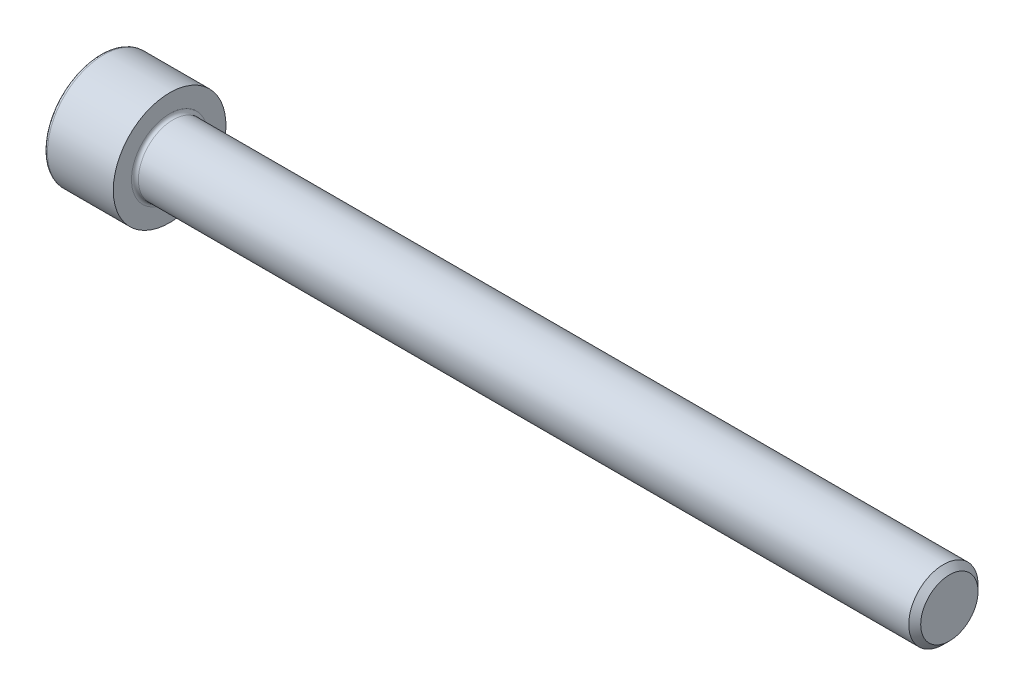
ISO-10303-21;
HEADER;
FILE_DESCRIPTION(('STEP AP214'),'2;1');
FILE_NAME('part.step','',(''),(''),'','','');
FILE_SCHEMA(('AUTOMOTIVE_DESIGN { 1 0 10303 214 1 1 1 1 }'));
ENDSEC;
DATA;
#1=APPLICATION_CONTEXT('core data for automotive mechanical design processes');
#2=APPLICATION_PROTOCOL_DEFINITION('international standard','automotive_design',2000,#1);
#3=PRODUCT_CONTEXT('',#1,'mechanical');
#4=PRODUCT('Part','Part','',(#3));
#5=PRODUCT_RELATED_PRODUCT_CATEGORY('part','',(#4));
#6=PRODUCT_DEFINITION_FORMATION('','',#4);
#7=PRODUCT_DEFINITION_CONTEXT('part definition',#1,'design');
#8=PRODUCT_DEFINITION('design','',#6,#7);
#9=PRODUCT_DEFINITION_SHAPE('','',#8);
#10=(LENGTH_UNIT() NAMED_UNIT(*) SI_UNIT(.MILLI.,.METRE.));
#11=(NAMED_UNIT(*) PLANE_ANGLE_UNIT() SI_UNIT($,.RADIAN.));
#12=(NAMED_UNIT(*) SI_UNIT($,.STERADIAN.) SOLID_ANGLE_UNIT());
#13=UNCERTAINTY_MEASURE_WITH_UNIT(LENGTH_MEASURE(1.E-05),#10,'distance_accuracy_value','');
#14=(GEOMETRIC_REPRESENTATION_CONTEXT(3) GLOBAL_UNCERTAINTY_ASSIGNED_CONTEXT((#13)) GLOBAL_UNIT_ASSIGNED_CONTEXT((#10,
#11,#12)) REPRESENTATION_CONTEXT('',''));
#15=CARTESIAN_POINT('',(0.,0.,0.));
#16=DIRECTION('',(0.,0.,1.));
#17=DIRECTION('',(1.,0.,0.));
#18=AXIS2_PLACEMENT_3D('',#15,#16,#17);
#19=CARTESIAN_POINT('',(0.,0.,0.));
#20=DIRECTION('',(-1.,0.,0.));
#21=DIRECTION('',(0.,0.,1.));
#22=AXIS2_PLACEMENT_3D('',#19,#20,#21);
#23=PLANE('',#22);
#24=DIRECTION('',(0.,-0.499999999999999,0.866025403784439));
#25=VECTOR('',#24,1.);
#26=CARTESIAN_POINT('',(0.,3.51894989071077,0.));
#27=LINE('',#26,#25);
#28=CARTESIAN_POINT('',(0.,3.51894989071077,0.));
#29=VERTEX_POINT('',#28);
#30=CARTESIAN_POINT('',(0.,1.75947494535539,3.0475));
#31=VERTEX_POINT('',#30);
#32=EDGE_CURVE('E263',#29,#31,#27,.T.);
#33=ORIENTED_EDGE('',*,*,#32,.T.);
#34=DIRECTION('',(0.,1.,0.));
#35=VECTOR('',#34,1.);
#36=CARTESIAN_POINT('',(0.,-1.75947494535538,3.04750000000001));
#37=LINE('',#36,#35);
#38=CARTESIAN_POINT('',(0.,-1.75947494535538,3.04750000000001));
#39=VERTEX_POINT('',#38);
#40=EDGE_CURVE('E137',#39,#31,#37,.T.);
#41=ORIENTED_EDGE('',*,*,#40,.F.);
#42=DIRECTION('',(0.,-0.500000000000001,-0.866025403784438));
#43=VECTOR('',#42,1.);
#44=CARTESIAN_POINT('',(0.,-1.75947494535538,3.04750000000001));
#45=LINE('',#44,#43);
#46=CARTESIAN_POINT('',(0.,-3.51894989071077,0.));
#47=VERTEX_POINT('',#46);
#48=EDGE_CURVE('E270',#39,#47,#45,.T.);
#49=ORIENTED_EDGE('',*,*,#48,.T.);
#50=DIRECTION('',(0.,0.499999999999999,-0.866025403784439));
#51=VECTOR('',#50,1.);
#52=CARTESIAN_POINT('',(0.,-3.51894989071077,0.));
#53=LINE('',#52,#51);
#54=CARTESIAN_POINT('',(0.,-1.75947494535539,-3.0475));
#55=VERTEX_POINT('',#54);
#56=EDGE_CURVE('E268',#47,#55,#53,.T.);
#57=ORIENTED_EDGE('',*,*,#56,.T.);
#58=DIRECTION('',(0.,-1.,0.));
#59=VECTOR('',#58,1.);
#60=CARTESIAN_POINT('',(0.,1.75947494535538,-3.0475));
#61=LINE('',#60,#59);
#62=CARTESIAN_POINT('',(0.,1.75947494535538,-3.0475));
#63=VERTEX_POINT('',#62);
#64=EDGE_CURVE('E271',#63,#55,#61,.T.);
#65=ORIENTED_EDGE('',*,*,#64,.F.);
#66=DIRECTION('',(0.,-0.500000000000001,-0.866025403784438));
#67=VECTOR('',#66,1.);
#68=CARTESIAN_POINT('',(0.,3.51894989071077,0.));
#69=LINE('',#68,#67);
#70=EDGE_CURVE('E131',#29,#63,#69,.T.);
#71=ORIENTED_EDGE('',*,*,#70,.F.);
#72=EDGE_LOOP('',(#33,#41,#49,#57,#65,#71));
#73=FACE_BOUND('',#72,.T.);
#74=CARTESIAN_POINT('',(0.,0.,0.));
#75=DIRECTION('',(-1.,0.,0.));
#76=DIRECTION('',(0.,0.,1.));
#77=AXIS2_PLACEMENT_3D('',#74,#75,#76);
#78=CIRCLE('',#77,6.1);
#79=CARTESIAN_POINT('',(0.,0.,6.1));
#80=VERTEX_POINT('',#79);
#81=EDGE_CURVE('E48',#80,#80,#78,.T.);
#82=ORIENTED_EDGE('',*,*,#81,.T.);
#83=EDGE_LOOP('',(#82));
#84=FACE_BOUND('',#83,.T.);
#85=ADVANCED_FACE('F37',(#73,#84),#23,.T.);
#86=CARTESIAN_POINT('',(-31.75,0.,0.));
#87=DIRECTION('',(-1.,0.,0.));
#88=DIRECTION('',(0.,0.,1.));
#89=AXIS2_PLACEMENT_3D('',#86,#87,#88);
#90=CYLINDRICAL_SURFACE('',#89,6.5);
#91=CARTESIAN_POINT('',(0.399999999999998,0.,0.));
#92=DIRECTION('',(-1.,0.,0.));
#93=DIRECTION('',(0.,0.,1.));
#94=AXIS2_PLACEMENT_3D('',#91,#92,#93);
#95=CIRCLE('',#94,6.5);
#96=CARTESIAN_POINT('',(0.399999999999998,0.,6.5));
#97=VERTEX_POINT('',#96);
#98=EDGE_CURVE('E11',#97,#97,#95,.F.);
#99=ORIENTED_EDGE('',*,*,#98,.T.);
#100=EDGE_LOOP('',(#99));
#101=FACE_BOUND('',#100,.T.);
#102=CARTESIAN_POINT('',(8.,0.,0.));
#103=DIRECTION('',(-1.,0.,0.));
#104=DIRECTION('',(0.,0.,1.));
#105=AXIS2_PLACEMENT_3D('',#102,#103,#104);
#106=CIRCLE('',#105,6.5);
#107=CARTESIAN_POINT('',(8.,0.,6.5));
#108=VERTEX_POINT('',#107);
#109=EDGE_CURVE('E153',#108,#108,#106,.T.);
#110=ORIENTED_EDGE('',*,*,#109,.T.);
#111=EDGE_LOOP('',(#110));
#112=FACE_BOUND('',#111,.T.);
#113=ADVANCED_FACE('F177',(#101,#112),#90,.T.);
#114=CARTESIAN_POINT('',(8.,6.5,0.));
#115=DIRECTION('',(1.,0.,0.));
#116=DIRECTION('',(0.,0.,-1.));
#117=AXIS2_PLACEMENT_3D('',#114,#115,#116);
#118=PLANE('',#117);
#119=CARTESIAN_POINT('',(8.,0.,0.));
#120=DIRECTION('',(1.,0.,0.));
#121=DIRECTION('',(0.,0.,-1.));
#122=AXIS2_PLACEMENT_3D('',#119,#120,#121);
#123=CIRCLE('',#122,4.4);
#124=CARTESIAN_POINT('',(8.,0.,-4.4));
#125=VERTEX_POINT('',#124);
#126=EDGE_CURVE('E160',#125,#125,#123,.F.);
#127=ORIENTED_EDGE('',*,*,#126,.T.);
#128=EDGE_LOOP('',(#127));
#129=FACE_BOUND('',#128,.T.);
#130=ORIENTED_EDGE('',*,*,#109,.F.);
#131=EDGE_LOOP('',(#130));
#132=FACE_BOUND('',#131,.T.);
#133=ADVANCED_FACE('F183',(#129,#132),#118,.T.);
#134=CARTESIAN_POINT('',(-31.75,0.,0.));
#135=DIRECTION('',(-1.,0.,0.));
#136=DIRECTION('',(0.,0.,1.));
#137=AXIS2_PLACEMENT_3D('',#134,#135,#136);
#138=CYLINDRICAL_SURFACE('',#137,4.);
#139=CARTESIAN_POINT('',(8.4,0.,0.));
#140=DIRECTION('',(1.,0.,0.));
#141=DIRECTION('',(0.,0.,-1.));
#142=AXIS2_PLACEMENT_3D('',#139,#140,#141);
#143=CIRCLE('',#142,4.);
#144=CARTESIAN_POINT('',(8.4,0.,-4.));
#145=VERTEX_POINT('',#144);
#146=EDGE_CURVE('E158',#145,#145,#143,.T.);
#147=ORIENTED_EDGE('',*,*,#146,.T.);
#148=EDGE_LOOP('',(#147));
#149=FACE_BOUND('',#148,.T.);
#150=CARTESIAN_POINT('',(97.3095,0.,0.));
#151=DIRECTION('',(-1.,0.,0.));
#152=DIRECTION('',(0.,0.,1.));
#153=AXIS2_PLACEMENT_3D('',#150,#151,#152);
#154=CIRCLE('',#153,4.);
#155=CARTESIAN_POINT('',(97.3095,0.,4.));
#156=VERTEX_POINT('',#155);
#157=EDGE_CURVE('E151',#156,#156,#154,.T.);
#158=ORIENTED_EDGE('',*,*,#157,.T.);
#159=EDGE_LOOP('',(#158));
#160=FACE_BOUND('',#159,.T.);
#161=ADVANCED_FACE('F188',(#149,#160),#138,.T.);
#162=CARTESIAN_POINT('',(98.,0.,0.));
#163=DIRECTION('',(-1.,0.,0.));
#164=DIRECTION('',(0.,0.,1.));
#165=AXIS2_PLACEMENT_3D('',#162,#163,#164);
#166=CONICAL_SURFACE('',#165,3.3095,0.785398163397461);
#167=ORIENTED_EDGE('',*,*,#157,.F.);
#168=EDGE_LOOP('',(#167));
#169=FACE_BOUND('',#168,.T.);
#170=CARTESIAN_POINT('',(98.,0.,0.));
#171=DIRECTION('',(-1.,0.,0.));
#172=DIRECTION('',(0.,0.,1.));
#173=AXIS2_PLACEMENT_3D('',#170,#171,#172);
#174=CIRCLE('',#173,3.3095);
#175=CARTESIAN_POINT('',(98.,0.,3.3095));
#176=VERTEX_POINT('',#175);
#177=EDGE_CURVE('E150',#176,#176,#174,.T.);
#178=ORIENTED_EDGE('',*,*,#177,.T.);
#179=EDGE_LOOP('',(#178));
#180=FACE_BOUND('',#179,.T.);
#181=ADVANCED_FACE('F194',(#169,#180),#166,.T.);
#182=CARTESIAN_POINT('',(98.,3.3095,0.));
#183=DIRECTION('',(1.,0.,0.));
#184=DIRECTION('',(0.,0.,-1.));
#185=AXIS2_PLACEMENT_3D('',#182,#183,#184);
#186=PLANE('',#185);
#187=ORIENTED_EDGE('',*,*,#177,.F.);
#188=EDGE_LOOP('',(#187));
#189=FACE_BOUND('',#188,.T.);
#190=ADVANCED_FACE('F176',(#189),#186,.T.);
#191=CARTESIAN_POINT('',(8.4,0.,0.));
#192=DIRECTION('',(1.,0.,0.));
#193=DIRECTION('',(0.,0.,-1.));
#194=AXIS2_PLACEMENT_3D('',#191,#192,#193);
#195=TOROIDAL_SURFACE('',#194,4.4,0.4);
#196=ORIENTED_EDGE('',*,*,#146,.F.);
#197=EDGE_LOOP('',(#196));
#198=FACE_BOUND('',#197,.T.);
#199=ORIENTED_EDGE('',*,*,#126,.F.);
#200=EDGE_LOOP('',(#199));
#201=FACE_BOUND('',#200,.T.);
#202=ADVANCED_FACE('F170',(#198,#201),#195,.F.);
#203=CARTESIAN_POINT('',(0.399999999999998,0.,0.));
#204=DIRECTION('',(-1.,0.,0.));
#205=DIRECTION('',(0.,0.,1.));
#206=AXIS2_PLACEMENT_3D('',#203,#204,#205);
#207=TOROIDAL_SURFACE('',#206,6.1,0.4);
#208=ORIENTED_EDGE('',*,*,#98,.F.);
#209=EDGE_LOOP('',(#208));
#210=FACE_BOUND('',#209,.T.);
#211=ORIENTED_EDGE('',*,*,#81,.F.);
#212=EDGE_LOOP('',(#211));
#213=FACE_BOUND('',#212,.T.);
#214=ADVANCED_FACE('F45',(#210,#213),#207,.T.);
#215=CARTESIAN_POINT('',(4.,3.51894989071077,0.));
#216=DIRECTION('',(0.,-0.866025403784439,-0.499999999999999));
#217=DIRECTION('',(0.,0.499999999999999,-0.866025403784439));
#218=AXIS2_PLACEMENT_3D('',#215,#216,#217);
#219=PLANE('',#218);
#220=ORIENTED_EDGE('',*,*,#32,.F.);
#221=DIRECTION('',(-1.,0.,0.));
#222=VECTOR('',#221,1.);
#223=CARTESIAN_POINT('',(4.,3.51894989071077,0.));
#224=LINE('',#223,#222);
#225=CARTESIAN_POINT('',(4.,3.51894989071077,0.));
#226=VERTEX_POINT('',#225);
#227=EDGE_CURVE('E251',#226,#29,#224,.T.);
#228=ORIENTED_EDGE('',*,*,#227,.F.);
#229=DIRECTION('',(0.,-0.499999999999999,0.866025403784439));
#230=VECTOR('',#229,1.);
#231=CARTESIAN_POINT('',(4.,3.51894989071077,0.));
#232=LINE('',#231,#230);
#233=CARTESIAN_POINT('',(4.,2.63921241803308,1.52375));
#234=VERTEX_POINT('',#233);
#235=EDGE_CURVE('E124',#226,#234,#232,.T.);
#236=ORIENTED_EDGE('',*,*,#235,.T.);
#237=CARTESIAN_POINT('',(4.,1.75947494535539,3.0475));
#238=VERTEX_POINT('',#237);
#239=EDGE_CURVE('E112',#234,#238,#232,.T.);
#240=ORIENTED_EDGE('',*,*,#239,.T.);
#241=DIRECTION('',(-1.,0.,0.));
#242=VECTOR('',#241,1.);
#243=CARTESIAN_POINT('',(4.,1.75947494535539,3.0475));
#244=LINE('',#243,#242);
#245=EDGE_CURVE('E128',#238,#31,#244,.T.);
#246=ORIENTED_EDGE('',*,*,#245,.T.);
#247=EDGE_LOOP('',(#220,#228,#236,#240,#246));
#248=FACE_BOUND('',#247,.T.);
#249=ADVANCED_FACE('F130',(#248),#219,.T.);
#250=CARTESIAN_POINT('',(4.,-1.75947494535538,3.04750000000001));
#251=DIRECTION('',(0.,0.,1.));
#252=DIRECTION('',(0.,-1.,0.));
#253=AXIS2_PLACEMENT_3D('',#250,#251,#252);
#254=PLANE('',#253);
#255=ORIENTED_EDGE('',*,*,#40,.T.);
#256=ORIENTED_EDGE('',*,*,#245,.F.);
#257=DIRECTION('',(0.,1.,0.));
#258=VECTOR('',#257,1.);
#259=CARTESIAN_POINT('',(4.,-1.75947494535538,3.04750000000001));
#260=LINE('',#259,#258);
#261=CARTESIAN_POINT('',(4.,0.,3.04750000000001));
#262=VERTEX_POINT('',#261);
#263=EDGE_CURVE('E111',#262,#238,#260,.T.);
#264=ORIENTED_EDGE('',*,*,#263,.F.);
#265=CARTESIAN_POINT('',(4.,-1.75947494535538,3.04750000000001));
#266=VERTEX_POINT('',#265);
#267=EDGE_CURVE('E125',#266,#262,#260,.T.);
#268=ORIENTED_EDGE('',*,*,#267,.F.);
#269=DIRECTION('',(-1.,0.,0.));
#270=VECTOR('',#269,1.);
#271=CARTESIAN_POINT('',(4.,-1.75947494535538,3.04750000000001));
#272=LINE('',#271,#270);
#273=EDGE_CURVE('E139',#266,#39,#272,.T.);
#274=ORIENTED_EDGE('',*,*,#273,.T.);
#275=EDGE_LOOP('',(#255,#256,#264,#268,#274));
#276=FACE_BOUND('',#275,.T.);
#277=ADVANCED_FACE('F132',(#276),#254,.F.);
#278=CARTESIAN_POINT('',(4.,-1.75947494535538,3.04750000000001));
#279=DIRECTION('',(0.,0.866025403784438,-0.500000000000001));
#280=DIRECTION('',(0.,0.500000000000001,0.866025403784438));
#281=AXIS2_PLACEMENT_3D('',#278,#279,#280);
#282=PLANE('',#281);
#283=ORIENTED_EDGE('',*,*,#48,.F.);
#284=ORIENTED_EDGE('',*,*,#273,.F.);
#285=DIRECTION('',(0.,-0.500000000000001,-0.866025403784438));
#286=VECTOR('',#285,1.);
#287=CARTESIAN_POINT('',(4.,-1.75947494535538,3.04750000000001));
#288=LINE('',#287,#286);
#289=CARTESIAN_POINT('',(4.,-2.63921241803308,1.52375000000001));
#290=VERTEX_POINT('',#289);
#291=EDGE_CURVE('E291',#266,#290,#288,.T.);
#292=ORIENTED_EDGE('',*,*,#291,.T.);
#293=CARTESIAN_POINT('',(4.,-3.51894989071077,0.));
#294=VERTEX_POINT('',#293);
#295=EDGE_CURVE('E285',#290,#294,#288,.T.);
#296=ORIENTED_EDGE('',*,*,#295,.T.);
#297=DIRECTION('',(-1.,0.,0.));
#298=VECTOR('',#297,1.);
#299=CARTESIAN_POINT('',(4.,-3.51894989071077,0.));
#300=LINE('',#299,#298);
#301=EDGE_CURVE('E141',#294,#47,#300,.T.);
#302=ORIENTED_EDGE('',*,*,#301,.T.);
#303=EDGE_LOOP('',(#283,#284,#292,#296,#302));
#304=FACE_BOUND('',#303,.T.);
#305=ADVANCED_FACE('F206',(#304),#282,.T.);
#306=CARTESIAN_POINT('',(4.,-3.51894989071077,0.));
#307=DIRECTION('',(0.,0.866025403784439,0.499999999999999));
#308=DIRECTION('',(0.,-0.499999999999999,0.866025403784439));
#309=AXIS2_PLACEMENT_3D('',#306,#307,#308);
#310=PLANE('',#309);
#311=ORIENTED_EDGE('',*,*,#56,.F.);
#312=ORIENTED_EDGE('',*,*,#301,.F.);
#313=DIRECTION('',(0.,0.499999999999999,-0.866025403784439));
#314=VECTOR('',#313,1.);
#315=CARTESIAN_POINT('',(4.,-3.51894989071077,0.));
#316=LINE('',#315,#314);
#317=CARTESIAN_POINT('',(4.,-2.63921241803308,-1.52375));
#318=VERTEX_POINT('',#317);
#319=EDGE_CURVE('E256',#294,#318,#316,.T.);
#320=ORIENTED_EDGE('',*,*,#319,.T.);
#321=CARTESIAN_POINT('',(4.,-1.75947494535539,-3.0475));
#322=VERTEX_POINT('',#321);
#323=EDGE_CURVE('E292',#318,#322,#316,.T.);
#324=ORIENTED_EDGE('',*,*,#323,.T.);
#325=DIRECTION('',(-1.,0.,0.));
#326=VECTOR('',#325,1.);
#327=CARTESIAN_POINT('',(4.,-1.75947494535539,-3.0475));
#328=LINE('',#327,#326);
#329=EDGE_CURVE('E254',#322,#55,#328,.T.);
#330=ORIENTED_EDGE('',*,*,#329,.T.);
#331=EDGE_LOOP('',(#311,#312,#320,#324,#330));
#332=FACE_BOUND('',#331,.T.);
#333=ADVANCED_FACE('F212',(#332),#310,.T.);
#334=CARTESIAN_POINT('',(4.,1.75947494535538,-3.0475));
#335=DIRECTION('',(0.,0.,-1.));
#336=DIRECTION('',(0.,1.,0.));
#337=AXIS2_PLACEMENT_3D('',#334,#335,#336);
#338=PLANE('',#337);
#339=ORIENTED_EDGE('',*,*,#64,.T.);
#340=ORIENTED_EDGE('',*,*,#329,.F.);
#341=DIRECTION('',(0.,-1.,0.));
#342=VECTOR('',#341,1.);
#343=CARTESIAN_POINT('',(4.,1.75947494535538,-3.0475));
#344=LINE('',#343,#342);
#345=CARTESIAN_POINT('',(4.,0.,-3.0475));
#346=VERTEX_POINT('',#345);
#347=EDGE_CURVE('E260',#346,#322,#344,.T.);
#348=ORIENTED_EDGE('',*,*,#347,.F.);
#349=CARTESIAN_POINT('',(4.,1.75947494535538,-3.0475));
#350=VERTEX_POINT('',#349);
#351=EDGE_CURVE('E54',#350,#346,#344,.T.);
#352=ORIENTED_EDGE('',*,*,#351,.F.);
#353=DIRECTION('',(-1.,0.,0.));
#354=VECTOR('',#353,1.);
#355=CARTESIAN_POINT('',(4.,1.75947494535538,-3.0475));
#356=LINE('',#355,#354);
#357=EDGE_CURVE('E249',#350,#63,#356,.T.);
#358=ORIENTED_EDGE('',*,*,#357,.T.);
#359=EDGE_LOOP('',(#339,#340,#348,#352,#358));
#360=FACE_BOUND('',#359,.T.);
#361=ADVANCED_FACE('F211',(#360),#338,.F.);
#362=CARTESIAN_POINT('',(4.,3.51894989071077,0.));
#363=DIRECTION('',(0.,0.866025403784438,-0.500000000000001));
#364=DIRECTION('',(0.,0.500000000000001,0.866025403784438));
#365=AXIS2_PLACEMENT_3D('',#362,#363,#364);
#366=PLANE('',#365);
#367=ORIENTED_EDGE('',*,*,#70,.T.);
#368=ORIENTED_EDGE('',*,*,#357,.F.);
#369=DIRECTION('',(0.,-0.500000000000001,-0.866025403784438));
#370=VECTOR('',#369,1.);
#371=CARTESIAN_POINT('',(4.,3.51894989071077,0.));
#372=LINE('',#371,#370);
#373=CARTESIAN_POINT('',(4.,2.63921241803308,-1.52375));
#374=VERTEX_POINT('',#373);
#375=EDGE_CURVE('E239',#374,#350,#372,.T.);
#376=ORIENTED_EDGE('',*,*,#375,.F.);
#377=EDGE_CURVE('E246',#226,#374,#372,.T.);
#378=ORIENTED_EDGE('',*,*,#377,.F.);
#379=ORIENTED_EDGE('',*,*,#227,.T.);
#380=EDGE_LOOP('',(#367,#368,#376,#378,#379));
#381=FACE_BOUND('',#380,.T.);
#382=ADVANCED_FACE('F218',(#381),#366,.F.);
#383=CARTESIAN_POINT('',(4.,3.51894989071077,0.));
#384=DIRECTION('',(1.,0.,0.));
#385=DIRECTION('',(0.,0.,-1.));
#386=AXIS2_PLACEMENT_3D('',#383,#384,#385);
#387=PLANE('',#386);
#388=ORIENTED_EDGE('',*,*,#347,.T.);
#389=ORIENTED_EDGE('',*,*,#323,.F.);
#390=CARTESIAN_POINT('',(4.,0.,0.));
#391=DIRECTION('',(-1.,0.,0.));
#392=DIRECTION('',(0.,0.,1.));
#393=AXIS2_PLACEMENT_3D('',#390,#391,#392);
#394=CIRCLE('',#393,3.0475);
#395=EDGE_CURVE('E289',#346,#318,#394,.T.);
#396=ORIENTED_EDGE('',*,*,#395,.F.);
#397=EDGE_LOOP('',(#388,#389,#396));
#398=FACE_BOUND('',#397,.T.);
#399=ADVANCED_FACE('F224',(#398),#387,.F.);
#400=ORIENTED_EDGE('',*,*,#319,.F.);
#401=ORIENTED_EDGE('',*,*,#295,.F.);
#402=EDGE_CURVE('E142',#318,#290,#394,.T.);
#403=ORIENTED_EDGE('',*,*,#402,.F.);
#404=EDGE_LOOP('',(#400,#401,#403));
#405=FACE_BOUND('',#404,.T.);
#406=ADVANCED_FACE('F228',(#405),#387,.F.);
#407=ORIENTED_EDGE('',*,*,#291,.F.);
#408=ORIENTED_EDGE('',*,*,#267,.T.);
#409=EDGE_CURVE('E140',#290,#262,#394,.T.);
#410=ORIENTED_EDGE('',*,*,#409,.F.);
#411=EDGE_LOOP('',(#407,#408,#410));
#412=FACE_BOUND('',#411,.T.);
#413=ADVANCED_FACE('F233',(#412),#387,.F.);
#414=ORIENTED_EDGE('',*,*,#263,.T.);
#415=ORIENTED_EDGE('',*,*,#239,.F.);
#416=EDGE_CURVE('E120',#262,#234,#394,.T.);
#417=ORIENTED_EDGE('',*,*,#416,.F.);
#418=EDGE_LOOP('',(#414,#415,#417));
#419=FACE_BOUND('',#418,.T.);
#420=ADVANCED_FACE('F113',(#419),#387,.F.);
#421=ORIENTED_EDGE('',*,*,#235,.F.);
#422=ORIENTED_EDGE('',*,*,#377,.T.);
#423=EDGE_CURVE('E148',#234,#374,#394,.T.);
#424=ORIENTED_EDGE('',*,*,#423,.F.);
#425=EDGE_LOOP('',(#421,#422,#424));
#426=FACE_BOUND('',#425,.T.);
#427=ADVANCED_FACE('F234',(#426),#387,.F.);
#428=ORIENTED_EDGE('',*,*,#375,.T.);
#429=ORIENTED_EDGE('',*,*,#351,.T.);
#430=EDGE_CURVE('E243',#374,#346,#394,.T.);
#431=ORIENTED_EDGE('',*,*,#430,.F.);
#432=EDGE_LOOP('',(#428,#429,#431));
#433=FACE_BOUND('',#432,.T.);
#434=ADVANCED_FACE('F201',(#433),#387,.F.);
#435=CARTESIAN_POINT('',(4.,0.,0.));
#436=DIRECTION('',(-1.,0.,0.));
#437=DIRECTION('',(0.,0.,1.));
#438=AXIS2_PLACEMENT_3D('',#435,#436,#437);
#439=CONICAL_SURFACE('',#438,3.0475,1.04719755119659);
#440=CARTESIAN_POINT('',(5.75947494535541,0.,0.));
#441=VERTEX_POINT('',#440);
#442=VERTEX_LOOP('',#441);
#443=FACE_BOUND('',#442,.T.);
#444=ORIENTED_EDGE('',*,*,#416,.T.);
#445=ORIENTED_EDGE('',*,*,#423,.T.);
#446=ORIENTED_EDGE('',*,*,#430,.T.);
#447=ORIENTED_EDGE('',*,*,#395,.T.);
#448=ORIENTED_EDGE('',*,*,#402,.T.);
#449=ORIENTED_EDGE('',*,*,#409,.T.);
#450=EDGE_LOOP('',(#444,#445,#446,#447,#448,#449));
#451=FACE_BOUND('',#450,.T.);
#452=ADVANCED_FACE('F205',(#443,#451),#439,.F.);
#453=CLOSED_SHELL('',(#85,#113,#133,#161,#181,#190,#202,#214,#249,#277,#305,#333,#361,#382,#399,
#406,#413,#420,#427,#434,#452));
#454=MANIFOLD_SOLID_BREP('B2',#453);
#455=ADVANCED_BREP_SHAPE_REPRESENTATION('',(#18,#454),#14);
#456=SHAPE_DEFINITION_REPRESENTATION(#9,#455);
ENDSEC;
END-ISO-10303-21;
